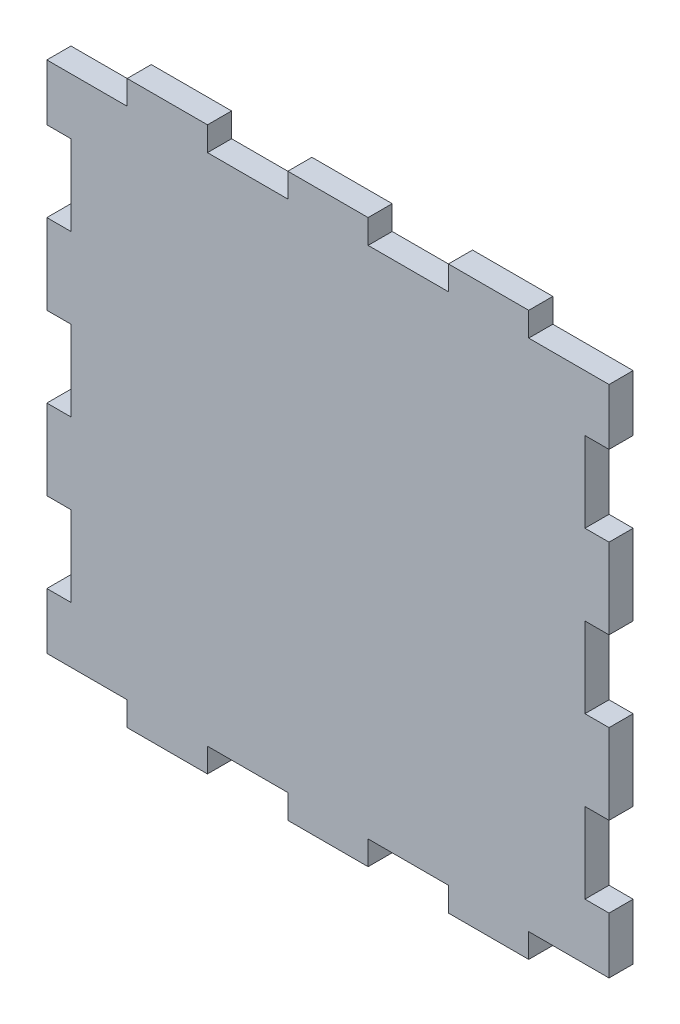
from build123d import *

# Parameters (mm, degrees)
SKETCH1_W           = 70
SKETCH1_H           = 70
BOSS_EXTRUDE1_DEPTH = 3
SKETCH2_W           = 10
SKETCH2_H           = 3
CUT_EXTRUDE1_DEPTH  = 3
SKETCH3_W           = 10
SKETCH3_H           = 3
CUT_EXTRUDE2_DEPTH  = 3
SKETCH4_W           = 3
SKETCH4_H           = 10
CUT_EXTRUDE3_DEPTH  = 3
SKETCH5_W           = 3
SKETCH5_H           = 10
CUT_EXTRUDE4_DEPTH  = 3


with BuildPart() as part:
    # Sketch1 → Boss-Extrude1 (new body)
    with BuildSketch(Plane.XY):
        Rectangle(SKETCH1_W, SKETCH1_H)
    extrude(amount=BOSS_EXTRUDE1_DEPTH)

    # Sketch2 → Cut-Extrude1 (cut)
    with BuildSketch(Plane(origin=(0, 0, 0), x_dir=(-1, 0, 0), z_dir=(0, 0, -1))):
        with Locations((-10, 33.5)):
            Rectangle(SKETCH2_W, SKETCH2_H)
        with Locations((-30, 33.5)):
            Rectangle(SKETCH2_W, SKETCH2_H)
        with Locations((10, 33.5)):
            Rectangle(SKETCH2_W, SKETCH2_H)
        with Locations((30, 33.5)):
            Rectangle(SKETCH2_W, SKETCH2_H)
    extrude(amount=-CUT_EXTRUDE1_DEPTH, mode=Mode.SUBTRACT)

    # Sketch3 → Cut-Extrude2 (cut)
    with BuildSketch(Plane(origin=(0, 0, 0), x_dir=(-1, 0, 0), z_dir=(0, 0, -1))):
        with Locations((-10, -33.5)):
            Rectangle(SKETCH3_W, SKETCH3_H)
        with Locations((-30, -33.5)):
            Rectangle(SKETCH3_W, SKETCH3_H)
        with Locations((10, -33.5)):
            Rectangle(SKETCH3_W, SKETCH3_H)
        with Locations((30, -33.5)):
            Rectangle(SKETCH3_W, SKETCH3_H)
    extrude(amount=-CUT_EXTRUDE2_DEPTH, mode=Mode.SUBTRACT)

    # Sketch4 → Cut-Extrude3 (cut)
    with BuildSketch(Plane(origin=(0, 0, 0), x_dir=(-1, 0, 0), z_dir=(0, 0, -1))):
        with Locations((-33.5, 20)):
            Rectangle(SKETCH4_W, SKETCH4_H)
        with Locations((-33.5, 0)):
            Rectangle(SKETCH4_W, SKETCH4_H)
        with Locations((-33.5, -20)):
            Rectangle(SKETCH4_W, SKETCH4_H)
    extrude(amount=-CUT_EXTRUDE3_DEPTH, mode=Mode.SUBTRACT)

    # Sketch5 → Cut-Extrude4 (cut)
    with BuildSketch(Plane(origin=(0, 0, 0), x_dir=(-1, 0, 0), z_dir=(0, 0, -1))):
        with Locations((33.5, 20)):
            Rectangle(SKETCH5_W, SKETCH5_H)
        with Locations((33.5, 0)):
            Rectangle(SKETCH5_W, SKETCH5_H)
        with Locations((33.5, -20)):
            Rectangle(SKETCH5_W, SKETCH5_H)
    extrude(amount=-CUT_EXTRUDE4_DEPTH, mode=Mode.SUBTRACT)


solid = part.part
